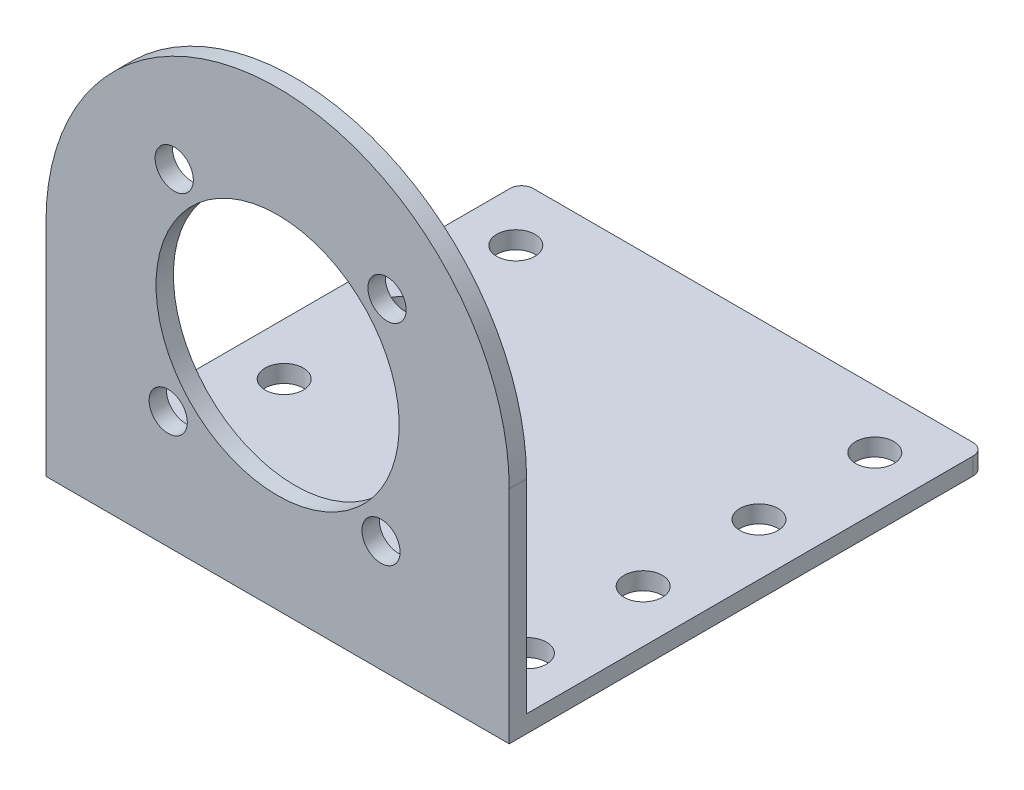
from build123d import *

# Parameters (mm, degrees)
SKETCH2_W           = 1.5
SKETCH2_H           = 37.57
SKETCH2_H_2         = 1.5
SKETCH2_W_2         = 39.569
BOSS_EXTRUDE1_DEPTH = 40
SKETCH3_R           = 1.65
CUT_EXTRUDE1_DEPTH  = 40
SKETCH4_R           = 10.5
SKETCH4_R_2         = 1.65
CUT_EXTRUDE2_DEPTH  = 40
FILLET1_R           = 1


with BuildPart() as part:
    # Sketch2 → Boss-Extrude1 (new body)
    with BuildSketch(Plane(origin=(0, 0, 0), x_dir=(0, 0, -1), z_dir=(1, 0, 0))):
        with Locations((-36.139408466, 17.750517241)):
            Rectangle(SKETCH2_W, SKETCH2_H)
        with Locations((-36.139408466, -1.784482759)):
            Rectangle(SKETCH2_W, SKETCH2_H_2)
        with Locations((-15.604908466, -1.784482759)):
            Rectangle(SKETCH2_W_2, SKETCH2_H_2)
    extrude(amount=BOSS_EXTRUDE1_DEPTH)

    # Sketch3 → Cut-Extrude1 (cut)
    with BuildSketch(Plane(origin=(0, -1.034482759, 0), x_dir=(1, 0, 0), z_dir=(0, 1, 0))):
        with Locations(Location((4.5, -30.820408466, 0), (0, 0, 270))):
            Circle(SKETCH3_R)
        with Locations(Location((4.5, -20.820408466, 0), (0, 0, 270))):
            Circle(SKETCH3_R)
        with Locations(Location((4.5, -10.820408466, 0), (0, 0, 270))):
            Circle(SKETCH3_R)
        with Locations(Location((4.5, -0.820408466, 0), (0, 0, 270))):
            Circle(SKETCH3_R)
        with Locations(Location((35.5, -30.820408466, 0), (0, 0, 270))):
            Circle(SKETCH3_R)
        with Locations(Location((35.5, -20.820408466, 0), (0, 0, 270))):
            Circle(SKETCH3_R)
        with Locations(Location((35.5, -10.820408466, 0), (0, 0, 270))):
            Circle(SKETCH3_R)
        with Locations(Location((35.5, -0.820408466, 0), (0, 0, 270))):
            Circle(SKETCH3_R)
    extrude(amount=-CUT_EXTRUDE1_DEPTH, mode=Mode.SUBTRACT)

    # Sketch4 → Cut-Extrude2 (cut)
    with BuildSketch(Plane(origin=(0, 0, 35.389408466), x_dir=(-1, 0, 0), z_dir=(0, 0, -1))):
        with Locations(Location((-20, 16.535517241, 0), (0, 0, 90))):
            Circle(SKETCH4_R)
        with Locations(Location((-11.070998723, 25.983952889, 0), (0, 0, 90))):
            Circle(SKETCH4_R_2)
        with Locations(Location((-10.551564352, 7.606515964, 0), (0, 0, 90))):
            Circle(SKETCH4_R_2)
        with Locations(Location((-29.448435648, 25.464518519, 0), (0, 0, 90))):
            Circle(SKETCH4_R_2)
        with Locations(Location((-28.929001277, 7.087081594, 0), (0, 0, 90))):
            Circle(SKETCH4_R_2)
        with BuildLine():
            Line((-40, 36.535517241), (-40, 16.535517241))
            ThreePointArc((-40, 16.535517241), (-34.142135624, 30.677652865), (-20, 36.535517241))
            Line((-20, 36.535517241), (-40, 36.535517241))
        make_face()
        with BuildLine():
            Line((0, 36.535517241), (-20, 36.535517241))
            ThreePointArc((-20, 36.535517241), (-5.857864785, 30.677653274), (0, 16.535518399))
            Line((0, 16.535518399), (0, 36.535517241))
        make_face()
    extrude(amount=-CUT_EXTRUDE2_DEPTH, mode=Mode.SUBTRACT)

    # Fillet1
    fillet1_edges = [part.edges().sort_by_distance(p)[0] for p in [
        (40, -1.784482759, -4.179591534),
        (0, -1.784482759, -4.179591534),
    ]]
    fillet(fillet1_edges, radius=FILLET1_R)


solid = part.part
